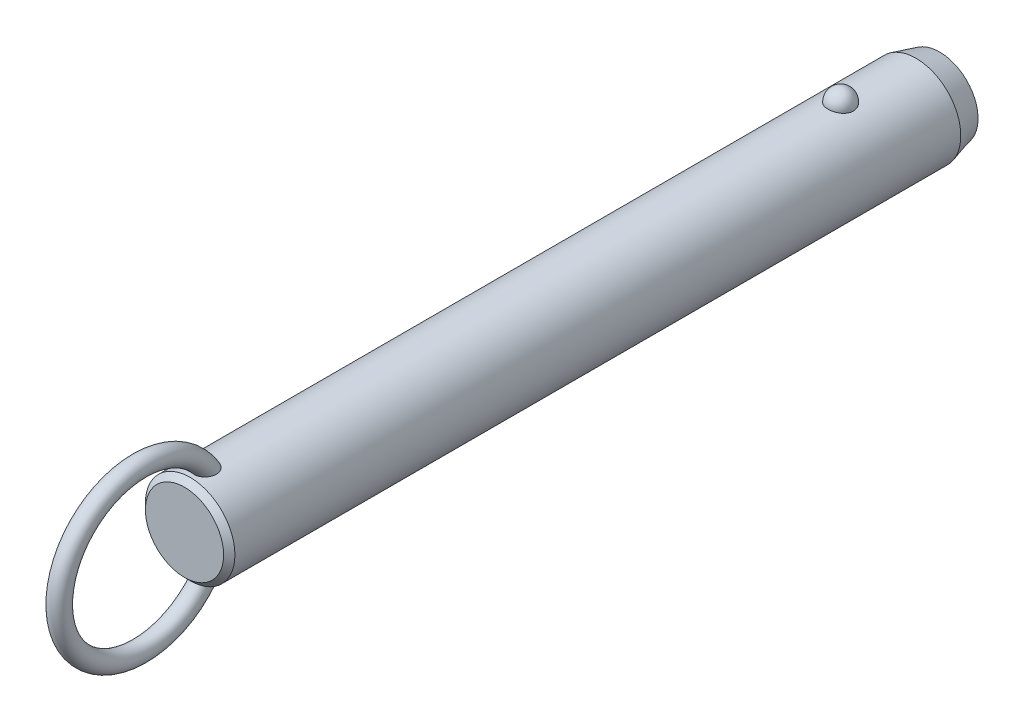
ISO-10303-21;
HEADER;
FILE_DESCRIPTION(('STEP AP214'),'2;1');
FILE_NAME('part.step','',(''),(''),'','','');
FILE_SCHEMA(('AUTOMOTIVE_DESIGN { 1 0 10303 214 1 1 1 1 }'));
ENDSEC;
DATA;
#1=APPLICATION_CONTEXT('core data for automotive mechanical design processes');
#2=APPLICATION_PROTOCOL_DEFINITION('international standard','automotive_design',2000,#1);
#3=PRODUCT_CONTEXT('',#1,'mechanical');
#4=PRODUCT('Part','Part','',(#3));
#5=PRODUCT_RELATED_PRODUCT_CATEGORY('part','',(#4));
#6=PRODUCT_DEFINITION_FORMATION('','',#4);
#7=PRODUCT_DEFINITION_CONTEXT('part definition',#1,'design');
#8=PRODUCT_DEFINITION('design','',#6,#7);
#9=PRODUCT_DEFINITION_SHAPE('','',#8);
#10=(LENGTH_UNIT() NAMED_UNIT(*) SI_UNIT(.MILLI.,.METRE.));
#11=(NAMED_UNIT(*) PLANE_ANGLE_UNIT() SI_UNIT($,.RADIAN.));
#12=(NAMED_UNIT(*) SI_UNIT($,.STERADIAN.) SOLID_ANGLE_UNIT());
#13=UNCERTAINTY_MEASURE_WITH_UNIT(LENGTH_MEASURE(1.E-05),#10,'distance_accuracy_value','');
#14=(GEOMETRIC_REPRESENTATION_CONTEXT(3) GLOBAL_UNCERTAINTY_ASSIGNED_CONTEXT((#13)) GLOBAL_UNIT_ASSIGNED_CONTEXT((#10,
#11,#12)) REPRESENTATION_CONTEXT('',''));
#15=CARTESIAN_POINT('',(0.,0.,0.));
#16=DIRECTION('',(0.,0.,1.));
#17=DIRECTION('',(1.,0.,0.));
#18=AXIS2_PLACEMENT_3D('',#15,#16,#17);
#19=CARTESIAN_POINT('',(0.,0.,127.));
#20=DIRECTION('',(0.,0.,-1.));
#21=DIRECTION('',(-1.,0.,0.));
#22=AXIS2_PLACEMENT_3D('',#19,#20,#21);
#23=CYLINDRICAL_SURFACE('',#22,9.5);
#24=CARTESIAN_POINT('',(2.67259918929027,9.11631578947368,-2.70000000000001));
#25=CARTESIAN_POINT('',(2.6725968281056,9.11631786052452,-2.54909854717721));
#26=CARTESIAN_POINT('',(2.66030567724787,9.11994722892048,-2.39816735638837));
#27=CARTESIAN_POINT('',(2.6114347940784,9.13405924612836,-2.10058568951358));
#28=CARTESIAN_POINT('',(2.57484658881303,9.14454428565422,-1.95393672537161));
#29=CARTESIAN_POINT('',(2.47830875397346,9.17117631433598,-1.66916069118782));
#30=CARTESIAN_POINT('',(2.41836936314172,9.18732082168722,-1.53102991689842));
#31=CARTESIAN_POINT('',(2.27661331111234,9.22346780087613,-1.26705393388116));
#32=CARTESIAN_POINT('',(2.19479699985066,9.24347021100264,-1.14120852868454));
#33=CARTESIAN_POINT('',(2.01085282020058,9.28522401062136,-0.904632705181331));
#34=CARTESIAN_POINT('',(1.90862396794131,9.30698376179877,-0.793982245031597));
#35=CARTESIAN_POINT('',(1.6867437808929,9.34973971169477,-0.591607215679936));
#36=CARTESIAN_POINT('',(1.56709244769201,9.37073591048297,-0.499882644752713));
#37=CARTESIAN_POINT('',(1.31393976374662,9.40956370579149,-0.338167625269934));
#38=CARTESIAN_POINT('',(1.18048026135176,9.42740444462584,-0.268113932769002));
#39=CARTESIAN_POINT('',(0.903154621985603,9.45799906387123,-0.151390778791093));
#40=CARTESIAN_POINT('',(0.759289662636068,9.47075351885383,-0.104718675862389));
#41=CARTESIAN_POINT('',(0.468074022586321,9.48956256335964,-0.0367633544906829));
#42=CARTESIAN_POINT('',(0.320836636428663,9.49573643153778,-0.0150275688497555));
#43=CARTESIAN_POINT('',(0.0246714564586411,9.50112183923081,0.00396199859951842));
#44=CARTESIAN_POINT('',(-0.124256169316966,9.50033406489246,0.00121819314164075));
#45=CARTESIAN_POINT('',(-0.417264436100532,9.4919475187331,-0.0284441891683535));
#46=CARTESIAN_POINT('',(-0.56138413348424,9.48444885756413,-0.0550074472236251));
#47=CARTESIAN_POINT('',(-0.842986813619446,9.46357853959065,-0.131064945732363));
#48=CARTESIAN_POINT('',(-0.980469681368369,9.450206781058,-0.180559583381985));
#49=CARTESIAN_POINT('',(-1.24585005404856,9.41890822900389,-0.301476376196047));
#50=CARTESIAN_POINT('',(-1.37368611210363,9.40095498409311,-0.373026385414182));
#51=CARTESIAN_POINT('',(-1.61552738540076,9.36242964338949,-0.536025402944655));
#52=CARTESIAN_POINT('',(-1.72953116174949,9.34185727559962,-0.627476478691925));
#53=CARTESIAN_POINT('',(-1.9429225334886,9.29984568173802,-0.829844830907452));
#54=CARTESIAN_POINT('',(-2.04198021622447,9.27839736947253,-0.94110821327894));
#55=CARTESIAN_POINT('',(-2.22026460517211,9.23735994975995,-1.17883414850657));
#56=CARTESIAN_POINT('',(-2.29948985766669,9.21777097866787,-1.30529781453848));
#57=CARTESIAN_POINT('',(-2.43697287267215,9.18238994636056,-1.57158566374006));
#58=CARTESIAN_POINT('',(-2.49497068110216,9.16664569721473,-1.71155057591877));
#59=CARTESIAN_POINT('',(-2.5872073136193,9.14104303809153,-1.99961197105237));
#60=CARTESIAN_POINT('',(-2.62144683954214,9.13118445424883,-2.14770821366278));
#61=CARTESIAN_POINT('',(-2.66521466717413,9.11850622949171,-2.44715424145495));
#62=CARTESIAN_POINT('',(-2.67484831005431,9.11565658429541,-2.59848735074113));
#63=CARTESIAN_POINT('',(-2.66946735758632,9.11723375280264,-2.90067317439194));
#64=CARTESIAN_POINT('',(-2.65445345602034,9.12166036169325,-3.05152590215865));
#65=CARTESIAN_POINT('',(-2.60029711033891,9.13724422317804,-3.34766110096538));
#66=CARTESIAN_POINT('',(-2.56127978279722,9.14836656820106,-3.49296833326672));
#67=CARTESIAN_POINT('',(-2.46018844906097,9.17606676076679,-3.77477535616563));
#68=CARTESIAN_POINT('',(-2.39811349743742,9.1926448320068,-3.9112747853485));
#69=CARTESIAN_POINT('',(-2.25202303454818,9.22952198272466,-4.17244273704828));
#70=CARTESIAN_POINT('',(-2.16788714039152,9.24984129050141,-4.29704106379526));
#71=CARTESIAN_POINT('',(-1.9799408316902,9.29188255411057,-4.53013066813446));
#72=CARTESIAN_POINT('',(-1.87612963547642,9.31360456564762,-4.63862130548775));
#73=CARTESIAN_POINT('',(-1.65105429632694,9.35612959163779,-4.8369029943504));
#74=CARTESIAN_POINT('',(-1.52972405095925,9.37692871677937,-4.92661991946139));
#75=CARTESIAN_POINT('',(-1.27318250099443,9.41518970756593,-5.08429106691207));
#76=CARTESIAN_POINT('',(-1.13797219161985,9.432651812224,-5.15224684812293));
#77=CARTESIAN_POINT('',(-0.859280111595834,9.46208255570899,-5.26371827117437));
#78=CARTESIAN_POINT('',(-0.715925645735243,9.47411833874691,-5.30753421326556));
#79=CARTESIAN_POINT('',(-0.423550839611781,9.4916822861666,-5.37076321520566));
#80=CARTESIAN_POINT('',(-0.2745312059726,9.49721125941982,-5.39017930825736));
#81=CARTESIAN_POINT('',(0.0218446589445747,9.50110860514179,-5.40390587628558));
#82=CARTESIAN_POINT('',(0.16917707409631,9.49961381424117,-5.39869609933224));
#83=CARTESIAN_POINT('',(0.460808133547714,9.48993906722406,-5.36441955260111));
#84=CARTESIAN_POINT('',(0.605106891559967,9.48175936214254,-5.33535367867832));
#85=CARTESIAN_POINT('',(0.886027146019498,9.4596376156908,-5.25435587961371));
#86=CARTESIAN_POINT('',(1.02267710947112,9.44571881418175,-5.20251612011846));
#87=CARTESIAN_POINT('',(1.28523827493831,9.41358993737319,-5.07741549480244));
#88=CARTESIAN_POINT('',(1.41114877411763,9.39537958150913,-5.00415322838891));
#89=CARTESIAN_POINT('',(1.65085227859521,9.3562644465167,-4.83684599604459));
#90=CARTESIAN_POINT('',(1.76442346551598,9.33532178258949,-4.74249218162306));
#91=CARTESIAN_POINT('',(1.97425672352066,9.29321198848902,-4.53620389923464));
#92=CARTESIAN_POINT('',(2.07051582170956,9.27204482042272,-4.42426641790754));
#93=CARTESIAN_POINT('',(2.24490086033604,9.23139221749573,-4.18363183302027));
#94=CARTESIAN_POINT('',(2.32267019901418,9.21194380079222,-4.05466990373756));
#95=CARTESIAN_POINT('',(2.45584092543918,9.1773419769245,-3.78517836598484));
#96=CARTESIAN_POINT('',(2.5112497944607,9.16218713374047,-3.64465264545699));
#97=CARTESIAN_POINT('',(2.59380876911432,9.13913522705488,-3.37104301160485));
#98=CARTESIAN_POINT('',(2.62330266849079,9.13064624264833,-3.23871053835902));
#99=CARTESIAN_POINT('',(2.66269870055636,9.11923566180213,-2.97092664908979));
#100=CARTESIAN_POINT('',(2.67260130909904,9.11631393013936,-2.83547530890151));
#101=CARTESIAN_POINT('',(2.67259918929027,9.11631578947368,-2.70000000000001));
#102=B_SPLINE_CURVE_WITH_KNOTS('',3,(#24,#25,#26,#27,#28,#29,#30,#31,#32,#33,#34,#35,#36,#37,
#38,#39,#40,#41,#42,#43,#44,#45,#46,#47,#48,#49,#50,#51,#52,#53,#54,#55,#56,#57,#58,#59,#60,#61,
#62,#63,#64,#65,#66,#67,#68,#69,#70,#71,#72,#73,#74,#75,#76,#77,#78,#79,#80,#81,#82,#83,#84,#85,
#86,#87,#88,#89,#90,#91,#92,#93,#94,#95,#96,#97,#98,#99,#100,#101),.UNSPECIFIED.,.T.,.F.,(4,2,2,
2,2,2,2,2,2,2,2,2,2,2,2,2,2,2,2,2,2,2,2,2,2,2,2,2,2,2,2,2,2,2,2,2,2,2,4),(0.,0.452217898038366,
0.904593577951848,1.35677112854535,1.80894144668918,2.26340676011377,2.71787203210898,
3.17099820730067,3.62407318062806,4.0687883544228,4.51345969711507,4.95160616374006,
5.38976021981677,5.83050358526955,6.27129275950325,6.72071308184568,7.17016633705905,
7.62495278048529,8.07972578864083,8.53254856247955,8.98535859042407,9.43582813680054,
9.88631615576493,10.3393155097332,10.7923328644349,11.2471065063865,11.7018475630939,
12.150795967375,12.599688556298,13.0398725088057,13.4800399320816,13.9184421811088,
14.3568730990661,14.802202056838,15.2476074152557,15.7010097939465,16.1542603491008,
16.5602594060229,16.966248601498),.UNSPECIFIED.);
#103=CARTESIAN_POINT('',(2.67259918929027,9.11631578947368,-2.70000000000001));
#104=VERTEX_POINT('',#103);
#105=EDGE_CURVE('E41',#104,#104,#102,.T.);
#106=ORIENTED_EDGE('',*,*,#105,.T.);
#107=EDGE_LOOP('',(#106));
#108=FACE_BOUND('',#107,.T.);
#109=CARTESIAN_POINT('',(0.,0.,135.32));
#110=DIRECTION('',(0.,0.,1.));
#111=DIRECTION('',(1.,0.,0.));
#112=AXIS2_PLACEMENT_3D('',#109,#110,#111);
#113=CIRCLE('',#112,9.5);
#114=CARTESIAN_POINT('',(9.5,0.,135.32));
#115=VERTEX_POINT('',#114);
#116=EDGE_CURVE('E10',#115,#115,#113,.F.);
#117=ORIENTED_EDGE('',*,*,#116,.T.);
#118=EDGE_LOOP('',(#117));
#119=FACE_BOUND('',#118,.T.);
#120=CARTESIAN_POINT('',(-0.697062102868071,-9.47439269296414,129.667808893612));
#121=CARTESIAN_POINT('',(-0.799579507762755,-9.46685146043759,129.707482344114));
#122=CARTESIAN_POINT('',(-0.898575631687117,-9.45788043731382,129.7559309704));
#123=CARTESIAN_POINT('',(-1.08670047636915,-9.43811593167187,129.868868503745));
#124=CARTESIAN_POINT('',(-1.17583204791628,-9.42732297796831,129.933352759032));
#125=CARTESIAN_POINT('',(-1.34179806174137,-9.40513672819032,130.076209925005));
#126=CARTESIAN_POINT('',(-1.41865133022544,-9.39374438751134,130.154561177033));
#127=CARTESIAN_POINT('',(-1.55860047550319,-9.37154196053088,130.322752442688));
#128=CARTESIAN_POINT('',(-1.62169476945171,-9.3607319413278,130.41259377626));
#129=CARTESIAN_POINT('',(-1.73527695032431,-9.34035749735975,130.604500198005));
#130=CARTESIAN_POINT('',(-1.78522266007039,-9.33085270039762,130.706891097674));
#131=CARTESIAN_POINT('',(-1.86924997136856,-9.3143834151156,130.918148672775));
#132=CARTESIAN_POINT('',(-1.90332570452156,-9.30741986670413,131.027017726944));
#133=CARTESIAN_POINT('',(-1.95893603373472,-9.29588482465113,131.260473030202));
#134=CARTESIAN_POINT('',(-1.97872420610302,-9.29165182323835,131.385489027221));
#135=CARTESIAN_POINT('',(-2.00062129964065,-9.28695978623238,131.637080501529));
#136=CARTESIAN_POINT('',(-2.00272284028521,-9.28650232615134,131.763656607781));
#137=CARTESIAN_POINT('',(-1.98958876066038,-9.28932750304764,132.036815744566));
#138=CARTESIAN_POINT('',(-1.97143366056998,-9.2932400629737,132.183251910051));
#139=CARTESIAN_POINT('',(-1.91479925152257,-9.30507151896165,132.472062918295));
#140=CARTESIAN_POINT('',(-1.87629122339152,-9.31299607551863,132.614431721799));
#141=CARTESIAN_POINT('',(-1.77225683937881,-9.33340232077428,132.915172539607));
#142=CARTESIAN_POINT('',(-1.70334898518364,-9.34641636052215,133.072369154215));
#143=CARTESIAN_POINT('',(-1.58111062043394,-9.36759153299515,133.297517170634));
#144=CARTESIAN_POINT('',(-1.53721459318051,-9.37492619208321,133.370796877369));
#145=CARTESIAN_POINT('',(-1.4430263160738,-9.38988566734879,133.51307405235));
#146=CARTESIAN_POINT('',(-1.39273721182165,-9.39751033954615,133.582073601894));
#147=CARTESIAN_POINT('',(-1.26775962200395,-9.41530678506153,133.736983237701));
#148=CARTESIAN_POINT('',(-1.19052326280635,-9.42548108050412,133.820871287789));
#149=CARTESIAN_POINT('',(-1.02420241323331,-9.44499825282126,133.976008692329));
#150=CARTESIAN_POINT('',(-0.93513986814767,-9.45434261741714,134.047280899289));
#151=CARTESIAN_POINT('',(-0.766610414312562,-9.46930670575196,134.158695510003));
#152=CARTESIAN_POINT('',(-0.689439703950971,-9.47529223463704,134.202235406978));
#153=CARTESIAN_POINT('',(-0.528942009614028,-9.48560294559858,134.27631336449));
#154=CARTESIAN_POINT('',(-0.445620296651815,-9.48992953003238,134.306862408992));
#155=CARTESIAN_POINT('',(-0.273901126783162,-9.49644161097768,134.352579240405));
#156=CARTESIAN_POINT('',(-0.18546574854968,-9.49860811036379,134.36761059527));
#157=CARTESIAN_POINT('',(-0.00734541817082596,-9.5004135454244,134.380149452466));
#158=CARTESIAN_POINT('',(0.0823387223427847,-9.50005405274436,134.377667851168));
#159=CARTESIAN_POINT('',(0.247679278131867,-9.49708301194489,134.356995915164));
#160=CARTESIAN_POINT('',(0.323620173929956,-9.49477609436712,134.340930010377));
#161=CARTESIAN_POINT('',(0.471981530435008,-9.48855917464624,134.297172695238));
#162=CARTESIAN_POINT('',(0.544400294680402,-9.48464840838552,134.269475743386));
#163=CARTESIAN_POINT('',(0.708947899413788,-9.47398336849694,134.19280266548));
#164=CARTESIAN_POINT('',(0.799149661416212,-9.46671310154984,134.139774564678));
#165=CARTESIAN_POINT('',(0.969783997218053,-9.45076225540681,134.019973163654));
#166=CARTESIAN_POINT('',(1.050194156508,-9.44207854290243,133.953169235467));
#167=CARTESIAN_POINT('',(1.23092343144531,-9.42051459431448,133.780759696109));
#168=CARTESIAN_POINT('',(1.32652499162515,-9.40733378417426,133.67026193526));
#169=CARTESIAN_POINT('',(1.49893121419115,-9.38140745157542,133.435561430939));
#170=CARTESIAN_POINT('',(1.5757161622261,-9.36866239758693,133.311344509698));
#171=CARTESIAN_POINT('',(1.71285426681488,-9.34457644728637,133.049389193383));
#172=CARTESIAN_POINT('',(1.77266365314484,-9.33328726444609,132.91136233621));
#173=CARTESIAN_POINT('',(1.87239208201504,-9.31379209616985,132.628051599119));
#174=CARTESIAN_POINT('',(1.91230158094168,-9.3055875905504,132.482764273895));
#175=CARTESIAN_POINT('',(1.97604189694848,-9.29228394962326,132.162028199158));
#176=CARTESIAN_POINT('',(1.9958743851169,-9.28797202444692,131.985724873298));
#177=CARTESIAN_POINT('',(2.0029570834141,-9.28645519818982,131.632414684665));
#178=CARTESIAN_POINT('',(1.99025930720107,-9.28923895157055,131.455409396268));
#179=CARTESIAN_POINT('',(1.93735479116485,-9.30038134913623,131.156338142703));
#180=CARTESIAN_POINT('',(1.90576827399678,-9.30697680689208,131.032667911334));
#181=CARTESIAN_POINT('',(1.8228748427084,-9.32356855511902,130.792329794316));
#182=CARTESIAN_POINT('',(1.77158213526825,-9.33356239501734,130.675656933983));
#183=CARTESIAN_POINT('',(1.64885744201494,-9.35602275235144,130.452706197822));
#184=CARTESIAN_POINT('',(1.57730995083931,-9.36850332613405,130.346492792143));
#185=CARTESIAN_POINT('',(1.41543264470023,-9.39431873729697,130.149553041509));
#186=CARTESIAN_POINT('',(1.32510883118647,-9.40765330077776,130.058821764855));
#187=CARTESIAN_POINT('',(1.13846223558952,-9.43195720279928,129.905033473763));
#188=CARTESIAN_POINT('',(1.04369890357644,-9.44302894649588,129.840094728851));
#189=CARTESIAN_POINT('',(0.843965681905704,-9.46296805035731,129.728038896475));
#190=CARTESIAN_POINT('',(0.739000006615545,-9.47183631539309,129.680914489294));
#191=CARTESIAN_POINT('',(0.528175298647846,-9.48586140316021,129.608117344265));
#192=CARTESIAN_POINT('',(0.422686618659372,-9.49119633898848,129.58140249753));
#193=CARTESIAN_POINT('',(0.208590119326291,-9.49831365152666,129.546013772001));
#194=CARTESIAN_POINT('',(0.0999817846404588,-9.500095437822,129.537342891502));
#195=CARTESIAN_POINT('',(-0.126104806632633,-9.49988861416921,129.538350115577));
#196=CARTESIAN_POINT('',(-0.243578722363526,-9.49757821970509,129.549594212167));
#197=CARTESIAN_POINT('',(-0.474390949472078,-9.48885165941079,129.593167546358));
#198=CARTESIAN_POINT('',(-0.587729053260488,-9.48243528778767,129.625497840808));
#199=CARTESIAN_POINT('',(-0.697062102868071,-9.47439269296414,129.667808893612));
#200=B_SPLINE_CURVE_WITH_KNOTS('',3,(#120,#121,#122,#123,#124,#125,#126,#127,#128,#129,#130,
#131,#132,#133,#134,#135,#136,#137,#138,#139,#140,#141,#142,#143,#144,#145,#146,#147,#148,#149,
#150,#151,#152,#153,#154,#155,#156,#157,#158,#159,#160,#161,#162,#163,#164,#165,#166,#167,#168,
#169,#170,#171,#172,#173,#174,#175,#176,#177,#178,#179,#180,#181,#182,#183,#184,#185,#186,#187,
#188,#189,#190,#191,#192,#193,#194,#195,#196,#197,#198,#199),.UNSPECIFIED.,.T.,.F.,(4,2,2,2,2,2,
2,2,2,2,2,2,2,2,2,2,2,2,2,2,2,2,2,2,2,2,2,2,2,2,2,2,2,2,2,2,2,2,2,4),(0.,0.330119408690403,
0.660143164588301,0.989655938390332,1.31920659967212,1.66074728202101,2.00241415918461,
2.38088696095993,2.75951768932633,3.20065679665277,3.64242004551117,4.15620996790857,
4.4131416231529,4.66994734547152,5.01228664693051,5.35399933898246,5.61943037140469,
5.88463652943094,6.15215502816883,6.4195070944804,6.65144391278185,6.88349136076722,
7.19641200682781,7.51003602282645,7.94779711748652,8.3860149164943,8.83699707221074,
9.28819530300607,9.81778662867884,10.34653170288,10.7284172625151,11.1100280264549,
11.4938603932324,11.8775702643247,12.2220189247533,12.5663259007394,12.8915939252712,
13.2169159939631,13.5689650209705,13.9210316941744),.UNSPECIFIED.);
#201=CARTESIAN_POINT('',(-0.697062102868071,-9.47439269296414,129.667808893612));
#202=VERTEX_POINT('',#201);
#203=EDGE_CURVE('E59',#202,#202,#200,.T.);
#204=ORIENTED_EDGE('',*,*,#203,.T.);
#205=EDGE_LOOP('',(#204));
#206=FACE_BOUND('',#205,.T.);
#207=CARTESIAN_POINT('',(-0.697062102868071,9.47439269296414,129.667808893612));
#208=CARTESIAN_POINT('',(-0.597792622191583,9.48169483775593,129.62939564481));
#209=CARTESIAN_POINT('',(-0.495106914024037,9.48766580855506,129.599168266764));
#210=CARTESIAN_POINT('',(-0.285876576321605,9.49627648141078,129.556032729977));
#211=CARTESIAN_POINT('',(-0.179324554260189,9.49890941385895,129.543159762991));
#212=CARTESIAN_POINT('',(0.0344157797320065,9.50053798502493,129.535166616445));
#213=CARTESIAN_POINT('',(0.141603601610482,9.49953613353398,129.540034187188));
#214=CARTESIAN_POINT('',(0.35356357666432,9.49401038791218,129.567365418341));
#215=CARTESIAN_POINT('',(0.458336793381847,9.48948807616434,129.58982117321));
#216=CARTESIAN_POINT('',(0.662493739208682,9.4774236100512,129.651671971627));
#217=CARTESIAN_POINT('',(0.761881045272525,9.46988348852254,129.691055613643));
#218=CARTESIAN_POINT('',(0.952608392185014,9.45260382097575,129.785634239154));
#219=CARTESIAN_POINT('',(1.04394806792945,9.44286417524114,129.840829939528));
#220=CARTESIAN_POINT('',(1.21712767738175,9.42211760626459,129.966066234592));
#221=CARTESIAN_POINT('',(1.29885671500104,9.41109835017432,130.036257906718));
#222=CARTESIAN_POINT('',(1.44978975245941,9.38903310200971,130.188980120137));
#223=CARTESIAN_POINT('',(1.51899278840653,9.37798710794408,130.271511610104));
#224=CARTESIAN_POINT('',(1.64602857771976,9.35654375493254,130.449776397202));
#225=CARTESIAN_POINT('',(1.70333052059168,9.34618688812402,130.545891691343));
#226=CARTESIAN_POINT('',(1.80259341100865,9.32755128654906,130.745897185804));
#227=CARTESIAN_POINT('',(1.84454942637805,9.31927322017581,130.849789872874));
#228=CARTESIAN_POINT('',(1.91637039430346,9.30478365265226,131.072213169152));
#229=CARTESIAN_POINT('',(1.944805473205,9.29882552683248,131.191219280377));
#230=CARTESIAN_POINT('',(1.98449865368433,9.29043398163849,131.432143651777));
#231=CARTESIAN_POINT('',(1.99574908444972,9.28800213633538,131.554063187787));
#232=CARTESIAN_POINT('',(2.00275141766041,9.28649645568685,131.816932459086));
#233=CARTESIAN_POINT('',(1.99588238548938,9.28799035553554,131.957952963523));
#234=CARTESIAN_POINT('',(1.96270559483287,9.29505517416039,132.237621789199));
#235=CARTESIAN_POINT('',(1.93637872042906,9.30063010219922,132.376267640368));
#236=CARTESIAN_POINT('',(1.85949176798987,9.31633564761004,132.672561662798));
#237=CARTESIAN_POINT('',(1.80549792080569,9.3270926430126,132.829290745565));
#238=CARTESIAN_POINT('',(1.67376869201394,9.3516306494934,133.132284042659));
#239=CARTESIAN_POINT('',(1.59603181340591,9.36541185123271,133.278547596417));
#240=CARTESIAN_POINT('',(1.4360277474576,9.39110706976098,133.525813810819));
#241=CARTESIAN_POINT('',(1.35831795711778,9.40278656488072,133.629791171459));
#242=CARTESIAN_POINT('',(1.18774483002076,9.42585025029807,133.824534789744));
#243=CARTESIAN_POINT('',(1.09490932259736,9.43723493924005,133.915324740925));
#244=CARTESIAN_POINT('',(0.92111037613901,9.45552616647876,134.05620334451));
#245=CARTESIAN_POINT('',(0.84373824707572,9.46281058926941,134.110656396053));
#246=CARTESIAN_POINT('',(0.681245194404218,9.47589120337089,134.206711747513));
#247=CARTESIAN_POINT('',(0.596135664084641,9.48168953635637,134.248332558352));
#248=CARTESIAN_POINT('',(0.433779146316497,9.49038144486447,134.310089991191));
#249=CARTESIAN_POINT('',(0.357459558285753,9.49359170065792,134.33260136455));
#250=CARTESIAN_POINT('',(0.202074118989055,9.49816761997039,134.364574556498));
#251=CARTESIAN_POINT('',(0.123010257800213,9.49953459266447,134.374045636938));
#252=CARTESIAN_POINT('',(-0.03573724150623,9.50026497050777,134.379114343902));
#253=CARTESIAN_POINT('',(-0.115421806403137,9.49962433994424,134.374684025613));
#254=CARTESIAN_POINT('',(-0.272823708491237,9.49640854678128,134.352296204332));
#255=CARTESIAN_POINT('',(-0.350540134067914,9.4938325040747,134.334332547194));
#256=CARTESIAN_POINT('',(-0.500580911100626,9.48709462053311,134.286802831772));
#257=CARTESIAN_POINT('',(-0.572979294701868,9.48296359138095,134.257461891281));
#258=CARTESIAN_POINT('',(-0.712864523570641,9.47347609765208,134.189008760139));
#259=CARTESIAN_POINT('',(-0.780349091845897,9.46811906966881,134.149892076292));
#260=CARTESIAN_POINT('',(-0.946309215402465,9.45329720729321,134.039432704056));
#261=CARTESIAN_POINT('',(-1.04090230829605,9.44321512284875,133.962329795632));
#262=CARTESIAN_POINT('',(-1.21661929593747,9.42219227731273,133.79409718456));
#263=CARTESIAN_POINT('',(-1.29770519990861,9.41124921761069,133.702929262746));
#264=CARTESIAN_POINT('',(-1.47319646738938,9.38563439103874,133.476162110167));
#265=CARTESIAN_POINT('',(-1.56208878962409,9.37102009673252,133.336289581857));
#266=CARTESIAN_POINT('',(-1.71623987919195,9.34401559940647,133.043950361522));
#267=CARTESIAN_POINT('',(-1.78147866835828,9.33162728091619,132.891473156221));
#268=CARTESIAN_POINT('',(-1.88853837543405,9.31055541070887,132.575647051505));
#269=CARTESIAN_POINT('',(-1.92998995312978,9.30193076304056,132.412168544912));
#270=CARTESIAN_POINT('',(-1.98590726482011,9.29015757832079,132.080526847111));
#271=CARTESIAN_POINT('',(-2.0004070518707,9.2870021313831,131.912369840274));
#272=CARTESIAN_POINT('',(-1.99964701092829,9.28716218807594,131.605080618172));
#273=CARTESIAN_POINT('',(-1.98908145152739,9.28945704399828,131.465936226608));
#274=CARTESIAN_POINT('',(-1.94566294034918,9.29865169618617,131.191153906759));
#275=CARTESIAN_POINT('',(-1.9128206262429,9.30554929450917,131.055514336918));
#276=CARTESIAN_POINT('',(-1.84582133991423,9.31898248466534,130.857802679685));
#277=CARTESIAN_POINT('',(-1.82038084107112,9.32400364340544,130.792583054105));
#278=CARTESIAN_POINT('',(-1.76350511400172,9.33492884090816,130.664903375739));
#279=CARTESIAN_POINT('',(-1.73207305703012,9.34083241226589,130.602441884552));
#280=CARTESIAN_POINT('',(-1.66324243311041,9.35333332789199,130.48094078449));
#281=CARTESIAN_POINT('',(-1.62584239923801,9.35993084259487,130.421902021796));
#282=CARTESIAN_POINT('',(-1.54527678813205,9.37356864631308,130.307987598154));
#283=CARTESIAN_POINT('',(-1.50211241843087,9.38060884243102,130.253111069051));
#284=CARTESIAN_POINT('',(-1.3768114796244,9.40004442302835,130.109961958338));
#285=CARTESIAN_POINT('',(-1.28916358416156,9.41261047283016,130.026429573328));
#286=CARTESIAN_POINT('',(-1.09996826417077,9.43658180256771,129.877236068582));
#287=CARTESIAN_POINT('',(-0.998461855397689,9.44799034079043,129.811523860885));
#288=CARTESIAN_POINT('',(-0.860188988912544,9.46103017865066,129.7394367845));
#289=CARTESIAN_POINT('',(-0.828141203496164,9.46389141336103,129.723851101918));
#290=CARTESIAN_POINT('',(-0.763210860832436,9.46934915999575,129.694473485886));
#291=CARTESIAN_POINT('',(-0.730328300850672,9.47194567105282,129.680681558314));
#292=CARTESIAN_POINT('',(-0.697062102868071,9.47439269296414,129.667808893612));
#293=B_SPLINE_CURVE_WITH_KNOTS('',3,(#207,#208,#209,#210,#211,#212,#213,#214,#215,#216,#217,
#218,#219,#220,#221,#222,#223,#224,#225,#226,#227,#228,#229,#230,#231,#232,#233,#234,#235,#236,
#237,#238,#239,#240,#241,#242,#243,#244,#245,#246,#247,#248,#249,#250,#251,#252,#253,#254,#255,
#256,#257,#258,#259,#260,#261,#262,#263,#264,#265,#266,#267,#268,#269,#270,#271,#272,#273,#274,
#275,#276,#277,#278,#279,#280,#281,#282,#283,#284,#285,#286,#287,#288,#289,#290,#291,#292),
.UNSPECIFIED.,.T.,.F.,(4,2,2,2,2,2,2,2,2,2,2,2,2,2,2,2,2,2,2,2,2,2,2,2,2,2,2,2,2,2,2,2,2,2,2,2,
2,2,2,2,2,2,4),(0.,0.319942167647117,0.640532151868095,0.96090081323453,1.2811255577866,
1.60113495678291,1.92115886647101,2.24457323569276,2.56801248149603,2.90371927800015,
3.23953387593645,3.60560313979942,3.97183576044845,4.39383693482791,4.8162532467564,
5.31257045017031,5.80891895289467,6.19868344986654,6.58773876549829,6.87145417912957,
7.15475838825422,7.39263751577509,7.63034760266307,7.86853584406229,8.10683246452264,
8.3406366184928,8.57454843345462,8.93983939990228,9.30614105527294,9.80266668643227,
10.2996107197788,10.8040753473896,11.3079021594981,11.7249776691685,12.1418541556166,
12.3521485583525,12.5623319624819,12.7725671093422,12.9827582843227,13.345827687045,
13.7078449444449,13.8150604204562,13.9222762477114),.UNSPECIFIED.);
#294=CARTESIAN_POINT('',(-0.697062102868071,9.47439269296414,129.667808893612));
#295=VERTEX_POINT('',#294);
#296=EDGE_CURVE('E67',#295,#295,#293,.T.);
#297=ORIENTED_EDGE('',*,*,#296,.T.);
#298=EDGE_LOOP('',(#297));
#299=FACE_BOUND('',#298,.T.);
#300=CARTESIAN_POINT('',(0.,0.,-18.6999999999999));
#301=DIRECTION('',(0.,0.,-1.));
#302=DIRECTION('',(-1.,0.,0.));
#303=AXIS2_PLACEMENT_3D('',#300,#301,#302);
#304=CIRCLE('',#303,9.5);
#305=CARTESIAN_POINT('',(-9.5,0.,-18.6999999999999));
#306=VERTEX_POINT('',#305);
#307=EDGE_CURVE('E56',#306,#306,#304,.F.);
#308=ORIENTED_EDGE('',*,*,#307,.T.);
#309=EDGE_LOOP('',(#308));
#310=FACE_BOUND('',#309,.T.);
#311=ADVANCED_FACE('F37',(#108,#119,#206,#299,#310),#23,.T.);
#312=CARTESIAN_POINT('',(0.,0.,-23.7));
#313=DIRECTION('',(0.,0.,-1.));
#314=DIRECTION('',(-1.,0.,0.));
#315=AXIS2_PLACEMENT_3D('',#312,#313,#314);
#316=PLANE('',#315);
#317=CARTESIAN_POINT('',(0.,0.,-23.7));
#318=DIRECTION('',(0.,0.,-1.));
#319=DIRECTION('',(-1.,0.,0.));
#320=AXIS2_PLACEMENT_3D('',#317,#318,#319);
#321=CIRCLE('',#320,8.16025403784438);
#322=CARTESIAN_POINT('',(-8.16025403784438,0.,-23.7));
#323=VERTEX_POINT('',#322);
#324=EDGE_CURVE('E66',#323,#323,#321,.T.);
#325=ORIENTED_EDGE('',*,*,#324,.T.);
#326=EDGE_LOOP('',(#325));
#327=FACE_BOUND('',#326,.T.);
#328=ADVANCED_FACE('F85',(#327),#316,.T.);
#329=CARTESIAN_POINT('',(0.,0.,-23.7));
#330=DIRECTION('',(0.,0.,1.));
#331=DIRECTION('',(1.,0.,0.));
#332=AXIS2_PLACEMENT_3D('',#329,#330,#331);
#333=CONICAL_SURFACE('',#332,8.16025403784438,0.261799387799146);
#334=ORIENTED_EDGE('',*,*,#307,.F.);
#335=EDGE_LOOP('',(#334));
#336=FACE_BOUND('',#335,.T.);
#337=ORIENTED_EDGE('',*,*,#324,.F.);
#338=EDGE_LOOP('',(#337));
#339=FACE_BOUND('',#338,.T.);
#340=ADVANCED_FACE('F83',(#336,#339),#333,.T.);
#341=CARTESIAN_POINT('',(0.,0.,136.52));
#342=DIRECTION('',(0.,0.,1.));
#343=DIRECTION('',(1.,0.,0.));
#344=AXIS2_PLACEMENT_3D('',#341,#342,#343);
#345=PLANE('',#344);
#346=CARTESIAN_POINT('',(0.,0.,136.52));
#347=DIRECTION('',(0.,0.,1.));
#348=DIRECTION('',(1.,0.,0.));
#349=AXIS2_PLACEMENT_3D('',#346,#347,#348);
#350=CIRCLE('',#349,8.30000000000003);
#351=CARTESIAN_POINT('',(8.30000000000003,0.,136.52));
#352=VERTEX_POINT('',#351);
#353=EDGE_CURVE('E50',#352,#352,#350,.T.);
#354=ORIENTED_EDGE('',*,*,#353,.T.);
#355=EDGE_LOOP('',(#354));
#356=FACE_BOUND('',#355,.T.);
#357=ADVANCED_FACE('F77',(#356),#345,.T.);
#358=CARTESIAN_POINT('',(0.,0.,146.05));
#359=DIRECTION('',(1.,0.,0.));
#360=DIRECTION('',(0.,0.,-1.));
#361=AXIS2_PLACEMENT_3D('',#358,#359,#360);
#362=TOROIDAL_SURFACE('',#361,17.05,2.);
#363=ORIENTED_EDGE('',*,*,#296,.F.);
#364=EDGE_LOOP('',(#363));
#365=FACE_BOUND('',#364,.T.);
#366=ORIENTED_EDGE('',*,*,#203,.F.);
#367=EDGE_LOOP('',(#366));
#368=FACE_BOUND('',#367,.T.);
#369=ADVANCED_FACE('F73',(#365,#368),#362,.T.);
#370=CARTESIAN_POINT('',(0.,0.,136.52));
#371=DIRECTION('',(0.,0.,-1.));
#372=DIRECTION('',(-1.,0.,0.));
#373=AXIS2_PLACEMENT_3D('',#370,#371,#372);
#374=CONICAL_SURFACE('',#373,8.30000000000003,0.785398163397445);
#375=ORIENTED_EDGE('',*,*,#116,.F.);
#376=EDGE_LOOP('',(#375));
#377=FACE_BOUND('',#376,.T.);
#378=ORIENTED_EDGE('',*,*,#353,.F.);
#379=EDGE_LOOP('',(#378));
#380=FACE_BOUND('',#379,.T.);
#381=ADVANCED_FACE('F39',(#377,#380),#374,.T.);
#382=CARTESIAN_POINT('',(0.,9.5,-2.70000000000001));
#383=DIRECTION('',(0.,1.,0.));
#384=DIRECTION('',(0.,0.,-1.));
#385=AXIS2_PLACEMENT_3D('',#382,#383,#384);
#386=SPHERICAL_SURFACE('',#385,2.7);
#387=ORIENTED_EDGE('',*,*,#105,.F.);
#388=EDGE_LOOP('',(#387));
#389=FACE_BOUND('',#388,.T.);
#390=ADVANCED_FACE('F79',(#389),#386,.T.);
#391=CLOSED_SHELL('',(#311,#328,#340,#357,#369,#381,#390));
#392=MANIFOLD_SOLID_BREP('B2',#391);
#393=ADVANCED_BREP_SHAPE_REPRESENTATION('',(#18,#392),#14);
#394=SHAPE_DEFINITION_REPRESENTATION(#9,#393);
ENDSEC;
END-ISO-10303-21;
